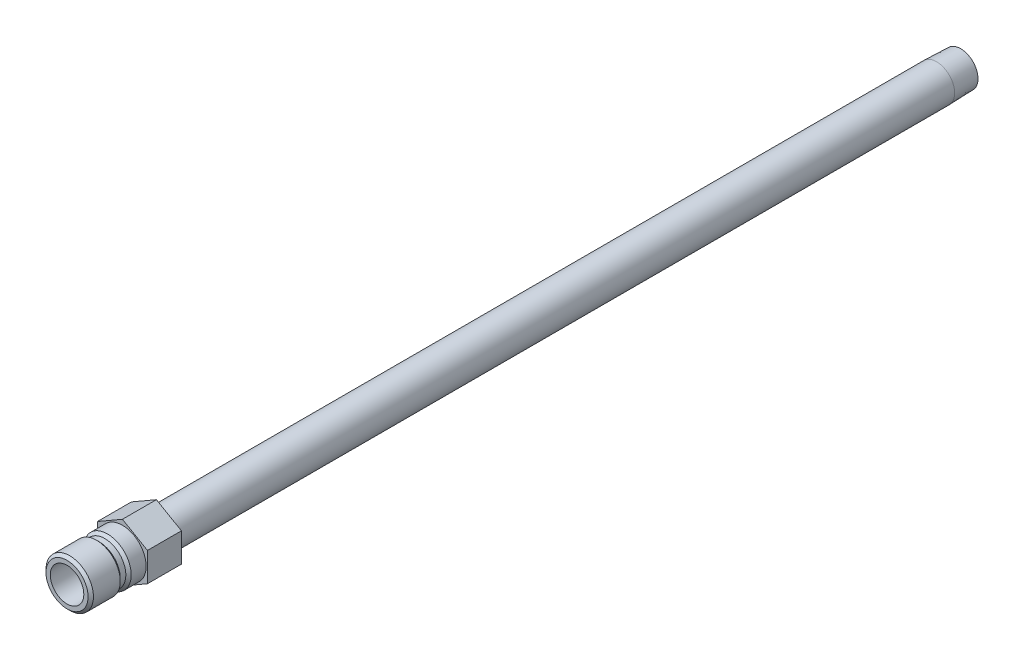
ISO-10303-21;
HEADER;
FILE_DESCRIPTION(('STEP AP214'),'2;1');
FILE_NAME('part.step','',(''),(''),'','','');
FILE_SCHEMA(('AUTOMOTIVE_DESIGN { 1 0 10303 214 1 1 1 1 }'));
ENDSEC;
DATA;
#1=APPLICATION_CONTEXT('core data for automotive mechanical design processes');
#2=APPLICATION_PROTOCOL_DEFINITION('international standard','automotive_design',2000,#1);
#3=PRODUCT_CONTEXT('',#1,'mechanical');
#4=PRODUCT('Part','Part','',(#3));
#5=PRODUCT_RELATED_PRODUCT_CATEGORY('part','',(#4));
#6=PRODUCT_DEFINITION_FORMATION('','',#4);
#7=PRODUCT_DEFINITION_CONTEXT('part definition',#1,'design');
#8=PRODUCT_DEFINITION('design','',#6,#7);
#9=PRODUCT_DEFINITION_SHAPE('','',#8);
#10=(LENGTH_UNIT() NAMED_UNIT(*) SI_UNIT(.MILLI.,.METRE.));
#11=(NAMED_UNIT(*) PLANE_ANGLE_UNIT() SI_UNIT($,.RADIAN.));
#12=(NAMED_UNIT(*) SI_UNIT($,.STERADIAN.) SOLID_ANGLE_UNIT());
#13=UNCERTAINTY_MEASURE_WITH_UNIT(LENGTH_MEASURE(1.E-05),#10,'distance_accuracy_value','');
#14=(GEOMETRIC_REPRESENTATION_CONTEXT(3) GLOBAL_UNCERTAINTY_ASSIGNED_CONTEXT((#13)) GLOBAL_UNIT_ASSIGNED_CONTEXT((#10,
#11,#12)) REPRESENTATION_CONTEXT('',''));
#15=CARTESIAN_POINT('',(0.,0.,0.));
#16=DIRECTION('',(0.,0.,1.));
#17=DIRECTION('',(1.,0.,0.));
#18=AXIS2_PLACEMENT_3D('',#15,#16,#17);
#19=CARTESIAN_POINT('',(0.,0.,-9.652));
#20=DIRECTION('',(0.,0.,-1.));
#21=DIRECTION('',(0.,1.,0.));
#22=AXIS2_PLACEMENT_3D('',#19,#20,#21);
#23=CYLINDRICAL_SURFACE('',#22,4.7625);
#24=CARTESIAN_POINT('',(0.,0.,3.556));
#25=DIRECTION('',(0.,0.,-1.));
#26=DIRECTION('',(0.,1.,0.));
#27=AXIS2_PLACEMENT_3D('',#24,#25,#26);
#28=CIRCLE('',#27,4.7625);
#29=CARTESIAN_POINT('',(0.,4.7625,3.556));
#30=VERTEX_POINT('',#29);
#31=EDGE_CURVE('E137',#30,#30,#28,.T.);
#32=ORIENTED_EDGE('',*,*,#31,.T.);
#33=EDGE_LOOP('',(#32));
#34=FACE_BOUND('',#33,.T.);
#35=CARTESIAN_POINT('',(0.,0.,15.748));
#36=DIRECTION('',(0.,0.,-1.));
#37=DIRECTION('',(0.,1.,0.));
#38=AXIS2_PLACEMENT_3D('',#35,#36,#37);
#39=CIRCLE('',#38,4.7625);
#40=CARTESIAN_POINT('',(0.,4.7625,15.748));
#41=VERTEX_POINT('',#40);
#42=EDGE_CURVE('E41',#41,#41,#39,.T.);
#43=ORIENTED_EDGE('',*,*,#42,.F.);
#44=EDGE_LOOP('',(#43));
#45=FACE_BOUND('',#44,.T.);
#46=ADVANCED_FACE('F33',(#34,#45),#23,.F.);
#47=CARTESIAN_POINT('',(0.,4.7625,15.748));
#48=DIRECTION('',(0.,0.,1.));
#49=DIRECTION('',(0.,-1.,0.));
#50=AXIS2_PLACEMENT_3D('',#47,#48,#49);
#51=PLANE('',#50);
#52=ORIENTED_EDGE('',*,*,#42,.T.);
#53=EDGE_LOOP('',(#52));
#54=FACE_BOUND('',#53,.T.);
#55=CARTESIAN_POINT('',(0.,0.,15.748));
#56=DIRECTION('',(0.,0.,-1.));
#57=DIRECTION('',(0.,1.,0.));
#58=AXIS2_PLACEMENT_3D('',#55,#56,#57);
#59=CIRCLE('',#58,5.9817);
#60=CARTESIAN_POINT('',(0.,5.9817,15.748));
#61=VERTEX_POINT('',#60);
#62=EDGE_CURVE('E175',#61,#61,#59,.T.);
#63=ORIENTED_EDGE('',*,*,#62,.F.);
#64=EDGE_LOOP('',(#63));
#65=FACE_BOUND('',#64,.T.);
#66=ADVANCED_FACE('F180',(#54,#65),#51,.T.);
#67=CARTESIAN_POINT('',(0.,0.,14.986));
#68=DIRECTION('',(0.,0.,-1.));
#69=DIRECTION('',(0.,1.,0.));
#70=AXIS2_PLACEMENT_3D('',#67,#68,#69);
#71=CONICAL_SURFACE('',#70,6.7437,0.785398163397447);
#72=ORIENTED_EDGE('',*,*,#62,.T.);
#73=EDGE_LOOP('',(#72));
#74=FACE_BOUND('',#73,.T.);
#75=CARTESIAN_POINT('',(0.,0.,14.986));
#76=DIRECTION('',(0.,0.,-1.));
#77=DIRECTION('',(0.,1.,0.));
#78=AXIS2_PLACEMENT_3D('',#75,#76,#77);
#79=CIRCLE('',#78,6.7437);
#80=CARTESIAN_POINT('',(0.,6.7437,14.986));
#81=VERTEX_POINT('',#80);
#82=EDGE_CURVE('E172',#81,#81,#79,.T.);
#83=ORIENTED_EDGE('',*,*,#82,.F.);
#84=EDGE_LOOP('',(#83));
#85=FACE_BOUND('',#84,.T.);
#86=ADVANCED_FACE('F188',(#74,#85),#71,.T.);
#87=CARTESIAN_POINT('',(0.,0.,-9.652));
#88=DIRECTION('',(0.,0.,-1.));
#89=DIRECTION('',(0.,1.,0.));
#90=AXIS2_PLACEMENT_3D('',#87,#88,#89);
#91=CYLINDRICAL_SURFACE('',#90,6.7437);
#92=ORIENTED_EDGE('',*,*,#82,.T.);
#93=EDGE_LOOP('',(#92));
#94=FACE_BOUND('',#93,.T.);
#95=CARTESIAN_POINT('',(0.,0.,7.366));
#96=DIRECTION('',(0.,0.,-1.));
#97=DIRECTION('',(0.,1.,0.));
#98=AXIS2_PLACEMENT_3D('',#95,#96,#97);
#99=CIRCLE('',#98,6.7437);
#100=CARTESIAN_POINT('',(0.,6.7437,7.366));
#101=VERTEX_POINT('',#100);
#102=EDGE_CURVE('E169',#101,#101,#99,.T.);
#103=ORIENTED_EDGE('',*,*,#102,.F.);
#104=EDGE_LOOP('',(#103));
#105=FACE_BOUND('',#104,.T.);
#106=ADVANCED_FACE('F237',(#94,#105),#91,.T.);
#107=CARTESIAN_POINT('',(0.,0.,6.604));
#108=DIRECTION('',(0.,0.,1.));
#109=DIRECTION('',(0.,-1.,0.));
#110=AXIS2_PLACEMENT_3D('',#107,#108,#109);
#111=CONICAL_SURFACE('',#110,5.9817,0.785398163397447);
#112=ORIENTED_EDGE('',*,*,#102,.T.);
#113=EDGE_LOOP('',(#112));
#114=FACE_BOUND('',#113,.T.);
#115=CARTESIAN_POINT('',(0.,0.,6.604));
#116=DIRECTION('',(0.,0.,-1.));
#117=DIRECTION('',(0.,1.,0.));
#118=AXIS2_PLACEMENT_3D('',#115,#116,#117);
#119=CIRCLE('',#118,5.9817);
#120=CARTESIAN_POINT('',(0.,5.9817,6.604));
#121=VERTEX_POINT('',#120);
#122=EDGE_CURVE('E166',#121,#121,#119,.T.);
#123=ORIENTED_EDGE('',*,*,#122,.F.);
#124=EDGE_LOOP('',(#123));
#125=FACE_BOUND('',#124,.T.);
#126=ADVANCED_FACE('F233',(#114,#125),#111,.T.);
#127=CARTESIAN_POINT('',(0.,0.,-9.652));
#128=DIRECTION('',(0.,0.,-1.));
#129=DIRECTION('',(0.,1.,0.));
#130=AXIS2_PLACEMENT_3D('',#127,#128,#129);
#131=CYLINDRICAL_SURFACE('',#130,5.9817);
#132=ORIENTED_EDGE('',*,*,#122,.T.);
#133=EDGE_LOOP('',(#132));
#134=FACE_BOUND('',#133,.T.);
#135=CARTESIAN_POINT('',(0.,0.,5.0165));
#136=DIRECTION('',(0.,0.,-1.));
#137=DIRECTION('',(0.,1.,0.));
#138=AXIS2_PLACEMENT_3D('',#135,#136,#137);
#139=CIRCLE('',#138,5.9817);
#140=CARTESIAN_POINT('',(0.,5.9817,5.0165));
#141=VERTEX_POINT('',#140);
#142=EDGE_CURVE('E163',#141,#141,#139,.T.);
#143=ORIENTED_EDGE('',*,*,#142,.F.);
#144=EDGE_LOOP('',(#143));
#145=FACE_BOUND('',#144,.T.);
#146=ADVANCED_FACE('F229',(#134,#145),#131,.T.);
#147=CARTESIAN_POINT('',(0.,0.,4.2545));
#148=DIRECTION('',(0.,0.,-1.));
#149=DIRECTION('',(0.,1.,0.));
#150=AXIS2_PLACEMENT_3D('',#147,#148,#149);
#151=CONICAL_SURFACE('',#150,6.7437,0.785398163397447);
#152=ORIENTED_EDGE('',*,*,#142,.T.);
#153=EDGE_LOOP('',(#152));
#154=FACE_BOUND('',#153,.T.);
#155=CARTESIAN_POINT('',(0.,0.,4.2545));
#156=DIRECTION('',(0.,0.,-1.));
#157=DIRECTION('',(0.,1.,0.));
#158=AXIS2_PLACEMENT_3D('',#155,#156,#157);
#159=CIRCLE('',#158,6.7437);
#160=CARTESIAN_POINT('',(0.,6.7437,4.2545));
#161=VERTEX_POINT('',#160);
#162=EDGE_CURVE('E160',#161,#161,#159,.T.);
#163=ORIENTED_EDGE('',*,*,#162,.F.);
#164=EDGE_LOOP('',(#163));
#165=FACE_BOUND('',#164,.T.);
#166=ADVANCED_FACE('F225',(#154,#165),#151,.T.);
#167=CARTESIAN_POINT('',(0.,0.,-9.652));
#168=DIRECTION('',(0.,0.,-1.));
#169=DIRECTION('',(0.,1.,0.));
#170=AXIS2_PLACEMENT_3D('',#167,#168,#169);
#171=CYLINDRICAL_SURFACE('',#170,6.7437);
#172=CARTESIAN_POINT('',(0.,0.,0.));
#173=DIRECTION('',(0.,0.,1.));
#174=DIRECTION('',(1.,0.,0.));
#175=AXIS2_PLACEMENT_3D('',#172,#173,#174);
#176=CIRCLE('',#175,6.7437);
#177=CARTESIAN_POINT('',(6.7437,0.,0.));
#178=VERTEX_POINT('',#177);
#179=EDGE_CURVE('E11',#178,#178,#176,.F.);
#180=ORIENTED_EDGE('',*,*,#179,.F.);
#181=EDGE_LOOP('',(#180));
#182=FACE_BOUND('',#181,.T.);
#183=ORIENTED_EDGE('',*,*,#162,.T.);
#184=EDGE_LOOP('',(#183));
#185=FACE_BOUND('',#184,.T.);
#186=ADVANCED_FACE('F221',(#182,#185),#171,.T.);
#187=CARTESIAN_POINT('',(0.,6.7437,-9.652));
#188=DIRECTION('',(0.,0.,-1.));
#189=DIRECTION('',(0.,1.,0.));
#190=AXIS2_PLACEMENT_3D('',#187,#188,#189);
#191=PLANE('',#190);
#192=CARTESIAN_POINT('',(0.,0.,-9.652));
#193=DIRECTION('',(0.,0.,-1.));
#194=DIRECTION('',(0.,1.,0.));
#195=AXIS2_PLACEMENT_3D('',#192,#193,#194);
#196=CIRCLE('',#195,5.1435);
#197=CARTESIAN_POINT('',(0.,5.1435,-9.652));
#198=VERTEX_POINT('',#197);
#199=EDGE_CURVE('E157',#198,#198,#196,.T.);
#200=ORIENTED_EDGE('',*,*,#199,.F.);
#201=EDGE_LOOP('',(#200));
#202=FACE_BOUND('',#201,.T.);
#203=DIRECTION('',(-0.866025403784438,-0.5,0.));
#204=VECTOR('',#203,1.);
#205=CARTESIAN_POINT('',(0.,8.21223022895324,-9.652));
#206=LINE('',#205,#204);
#207=CARTESIAN_POINT('',(0.,8.21223022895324,-9.652));
#208=VERTEX_POINT('',#207);
#209=CARTESIAN_POINT('',(-7.112,4.10611511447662,-9.652));
#210=VERTEX_POINT('',#209);
#211=EDGE_CURVE('E135',#208,#210,#206,.T.);
#212=ORIENTED_EDGE('',*,*,#211,.F.);
#213=DIRECTION('',(-0.866025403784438,0.5,0.));
#214=VECTOR('',#213,1.);
#215=CARTESIAN_POINT('',(7.112,4.10611511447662,-9.652));
#216=LINE('',#215,#214);
#217=CARTESIAN_POINT('',(7.112,4.10611511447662,-9.652));
#218=VERTEX_POINT('',#217);
#219=EDGE_CURVE('E110',#218,#208,#216,.T.);
#220=ORIENTED_EDGE('',*,*,#219,.F.);
#221=DIRECTION('',(0.,1.,0.));
#222=VECTOR('',#221,1.);
#223=CARTESIAN_POINT('',(7.112,-4.10611511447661,-9.652));
#224=LINE('',#223,#222);
#225=CARTESIAN_POINT('',(7.112,-4.10611511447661,-9.652));
#226=VERTEX_POINT('',#225);
#227=EDGE_CURVE('E95',#226,#218,#224,.T.);
#228=ORIENTED_EDGE('',*,*,#227,.F.);
#229=DIRECTION('',(0.866025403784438,0.5,0.));
#230=VECTOR('',#229,1.);
#231=CARTESIAN_POINT('',(0.,-8.21223022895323,-9.652));
#232=LINE('',#231,#230);
#233=CARTESIAN_POINT('',(0.,-8.21223022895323,-9.652));
#234=VERTEX_POINT('',#233);
#235=EDGE_CURVE('E108',#234,#226,#232,.T.);
#236=ORIENTED_EDGE('',*,*,#235,.F.);
#237=DIRECTION('',(0.866025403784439,-0.5,0.));
#238=VECTOR('',#237,1.);
#239=CARTESIAN_POINT('',(-7.112,-4.10611511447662,-9.652));
#240=LINE('',#239,#238);
#241=CARTESIAN_POINT('',(-7.112,-4.10611511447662,-9.652));
#242=VERTEX_POINT('',#241);
#243=EDGE_CURVE('E113',#242,#234,#240,.T.);
#244=ORIENTED_EDGE('',*,*,#243,.F.);
#245=DIRECTION('',(0.,-1.,0.));
#246=VECTOR('',#245,1.);
#247=CARTESIAN_POINT('',(-7.112,4.10611511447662,-9.652));
#248=LINE('',#247,#246);
#249=EDGE_CURVE('E115',#210,#242,#248,.T.);
#250=ORIENTED_EDGE('',*,*,#249,.F.);
#251=EDGE_LOOP('',(#212,#220,#228,#236,#244,#250));
#252=FACE_BOUND('',#251,.T.);
#253=ADVANCED_FACE('F106',(#202,#252),#191,.T.);
#254=CARTESIAN_POINT('',(0.,0.,-9.652));
#255=DIRECTION('',(0.,0.,-1.));
#256=DIRECTION('',(0.,1.,0.));
#257=AXIS2_PLACEMENT_3D('',#254,#255,#256);
#258=CYLINDRICAL_SURFACE('',#257,5.14349999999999);
#259=ORIENTED_EDGE('',*,*,#199,.T.);
#260=EDGE_LOOP('',(#259));
#261=FACE_BOUND('',#260,.T.);
#262=CARTESIAN_POINT('',(0.,0.,-231.394));
#263=DIRECTION('',(0.,0.,-1.));
#264=DIRECTION('',(0.,1.,0.));
#265=AXIS2_PLACEMENT_3D('',#262,#263,#264);
#266=CIRCLE('',#265,5.14349999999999);
#267=CARTESIAN_POINT('',(0.,5.1435,-231.394));
#268=VERTEX_POINT('',#267);
#269=EDGE_CURVE('E154',#268,#268,#266,.T.);
#270=ORIENTED_EDGE('',*,*,#269,.F.);
#271=EDGE_LOOP('',(#270));
#272=FACE_BOUND('',#271,.T.);
#273=ADVANCED_FACE('F214',(#261,#272),#258,.T.);
#274=CARTESIAN_POINT('',(0.,0.,-238.252));
#275=DIRECTION('',(0.,0.,1.));
#276=DIRECTION('',(0.,-1.,0.));
#277=AXIS2_PLACEMENT_3D('',#274,#275,#276);
#278=CONICAL_SURFACE('',#277,4.92918877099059,0.0312396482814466);
#279=ORIENTED_EDGE('',*,*,#269,.T.);
#280=EDGE_LOOP('',(#279));
#281=FACE_BOUND('',#280,.T.);
#282=CARTESIAN_POINT('',(0.,0.,-238.252));
#283=DIRECTION('',(0.,0.,-1.));
#284=DIRECTION('',(0.,1.,0.));
#285=AXIS2_PLACEMENT_3D('',#282,#283,#284);
#286=CIRCLE('',#285,4.92918877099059);
#287=CARTESIAN_POINT('',(0.,4.9291887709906,-238.252));
#288=VERTEX_POINT('',#287);
#289=EDGE_CURVE('E151',#288,#288,#286,.T.);
#290=ORIENTED_EDGE('',*,*,#289,.F.);
#291=EDGE_LOOP('',(#290));
#292=FACE_BOUND('',#291,.T.);
#293=ADVANCED_FACE('F210',(#281,#292),#278,.T.);
#294=CARTESIAN_POINT('',(0.,4.9291887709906,-238.252));
#295=DIRECTION('',(0.,0.,-1.));
#296=DIRECTION('',(0.,1.,0.));
#297=AXIS2_PLACEMENT_3D('',#294,#295,#296);
#298=PLANE('',#297);
#299=ORIENTED_EDGE('',*,*,#289,.T.);
#300=EDGE_LOOP('',(#299));
#301=FACE_BOUND('',#300,.T.);
#302=CARTESIAN_POINT('',(0.,0.,-238.252));
#303=DIRECTION('',(0.,0.,-1.));
#304=DIRECTION('',(0.,1.,0.));
#305=AXIS2_PLACEMENT_3D('',#302,#303,#304);
#306=CIRCLE('',#305,3.41629999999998);
#307=CARTESIAN_POINT('',(0.,3.4163,-238.252));
#308=VERTEX_POINT('',#307);
#309=EDGE_CURVE('E148',#308,#308,#306,.T.);
#310=ORIENTED_EDGE('',*,*,#309,.F.);
#311=EDGE_LOOP('',(#310));
#312=FACE_BOUND('',#311,.T.);
#313=ADVANCED_FACE('F203',(#301,#312),#298,.T.);
#314=CARTESIAN_POINT('',(0.,0.,-9.652));
#315=DIRECTION('',(0.,0.,-1.));
#316=DIRECTION('',(0.,1.,0.));
#317=AXIS2_PLACEMENT_3D('',#314,#315,#316);
#318=CYLINDRICAL_SURFACE('',#317,3.41629999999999);
#319=ORIENTED_EDGE('',*,*,#309,.T.);
#320=EDGE_LOOP('',(#319));
#321=FACE_BOUND('',#320,.T.);
#322=CARTESIAN_POINT('',(0.,0.,2.84021276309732));
#323=DIRECTION('',(0.,0.,-1.));
#324=DIRECTION('',(0.,1.,0.));
#325=AXIS2_PLACEMENT_3D('',#322,#323,#324);
#326=CIRCLE('',#325,3.4163);
#327=CARTESIAN_POINT('',(0.,3.4163,2.84021276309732));
#328=VERTEX_POINT('',#327);
#329=EDGE_CURVE('E145',#328,#328,#326,.T.);
#330=ORIENTED_EDGE('',*,*,#329,.F.);
#331=EDGE_LOOP('',(#330));
#332=FACE_BOUND('',#331,.T.);
#333=ADVANCED_FACE('F194',(#321,#332),#318,.F.);
#334=CARTESIAN_POINT('',(0.,0.,3.556));
#335=DIRECTION('',(0.,0.,1.));
#336=DIRECTION('',(0.,-1.,0.));
#337=AXIS2_PLACEMENT_3D('',#334,#335,#336);
#338=CONICAL_SURFACE('',#337,4.7625,1.08210413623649);
#339=ORIENTED_EDGE('',*,*,#329,.T.);
#340=EDGE_LOOP('',(#339));
#341=FACE_BOUND('',#340,.T.);
#342=ORIENTED_EDGE('',*,*,#31,.F.);
#343=EDGE_LOOP('',(#342));
#344=FACE_BOUND('',#343,.T.);
#345=ADVANCED_FACE('F191',(#341,#344),#338,.F.);
#346=CARTESIAN_POINT('',(0.,8.21223022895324,-9.652));
#347=DIRECTION('',(-0.5,0.866025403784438,0.));
#348=DIRECTION('',(-0.866025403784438,-0.5,0.));
#349=AXIS2_PLACEMENT_3D('',#346,#347,#348);
#350=PLANE('',#349);
#351=DIRECTION('',(-0.866025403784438,-0.5,0.));
#352=VECTOR('',#351,1.);
#353=CARTESIAN_POINT('',(0.,8.21223022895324,0.));
#354=LINE('',#353,#352);
#355=CARTESIAN_POINT('',(0.,8.21223022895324,0.));
#356=VERTEX_POINT('',#355);
#357=CARTESIAN_POINT('',(-7.112,4.10611511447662,0.));
#358=VERTEX_POINT('',#357);
#359=EDGE_CURVE('E120',#356,#358,#354,.T.);
#360=ORIENTED_EDGE('',*,*,#359,.F.);
#361=DIRECTION('',(0.,0.,1.));
#362=VECTOR('',#361,1.);
#363=CARTESIAN_POINT('',(0.,8.21223022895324,-9.652));
#364=LINE('',#363,#362);
#365=EDGE_CURVE('E49',#208,#356,#364,.T.);
#366=ORIENTED_EDGE('',*,*,#365,.F.);
#367=ORIENTED_EDGE('',*,*,#211,.T.);
#368=DIRECTION('',(0.,0.,1.));
#369=VECTOR('',#368,1.);
#370=CARTESIAN_POINT('',(-7.112,4.10611511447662,-9.652));
#371=LINE('',#370,#369);
#372=EDGE_CURVE('E84',#210,#358,#371,.T.);
#373=ORIENTED_EDGE('',*,*,#372,.T.);
#374=EDGE_LOOP('',(#360,#366,#367,#373));
#375=FACE_BOUND('',#374,.T.);
#376=ADVANCED_FACE('F193',(#375),#350,.T.);
#377=CARTESIAN_POINT('',(7.112,4.10611511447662,-9.652));
#378=DIRECTION('',(0.5,0.866025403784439,0.));
#379=DIRECTION('',(-0.866025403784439,0.5,0.));
#380=AXIS2_PLACEMENT_3D('',#377,#378,#379);
#381=PLANE('',#380);
#382=DIRECTION('',(-0.866025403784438,0.5,0.));
#383=VECTOR('',#382,1.);
#384=CARTESIAN_POINT('',(7.112,4.10611511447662,0.));
#385=LINE('',#384,#383);
#386=CARTESIAN_POINT('',(7.112,4.10611511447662,0.));
#387=VERTEX_POINT('',#386);
#388=EDGE_CURVE('E132',#387,#356,#385,.T.);
#389=ORIENTED_EDGE('',*,*,#388,.F.);
#390=DIRECTION('',(0.,0.,1.));
#391=VECTOR('',#390,1.);
#392=CARTESIAN_POINT('',(7.112,4.10611511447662,-9.652));
#393=LINE('',#392,#391);
#394=EDGE_CURVE('E72',#218,#387,#393,.T.);
#395=ORIENTED_EDGE('',*,*,#394,.F.);
#396=ORIENTED_EDGE('',*,*,#219,.T.);
#397=ORIENTED_EDGE('',*,*,#365,.T.);
#398=EDGE_LOOP('',(#389,#395,#396,#397));
#399=FACE_BOUND('',#398,.T.);
#400=ADVANCED_FACE('F201',(#399),#381,.T.);
#401=CARTESIAN_POINT('',(7.112,-4.10611511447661,-9.652));
#402=DIRECTION('',(1.,0.,0.));
#403=DIRECTION('',(0.,1.,0.));
#404=AXIS2_PLACEMENT_3D('',#401,#402,#403);
#405=PLANE('',#404);
#406=DIRECTION('',(0.,1.,0.));
#407=VECTOR('',#406,1.);
#408=CARTESIAN_POINT('',(7.112,-4.10611511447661,0.));
#409=LINE('',#408,#407);
#410=CARTESIAN_POINT('',(7.112,-4.10611511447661,0.));
#411=VERTEX_POINT('',#410);
#412=EDGE_CURVE('E97',#411,#387,#409,.T.);
#413=ORIENTED_EDGE('',*,*,#412,.F.);
#414=DIRECTION('',(0.,0.,1.));
#415=VECTOR('',#414,1.);
#416=CARTESIAN_POINT('',(7.112,-4.10611511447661,-9.652));
#417=LINE('',#416,#415);
#418=EDGE_CURVE('E92',#226,#411,#417,.T.);
#419=ORIENTED_EDGE('',*,*,#418,.F.);
#420=ORIENTED_EDGE('',*,*,#227,.T.);
#421=ORIENTED_EDGE('',*,*,#394,.T.);
#422=EDGE_LOOP('',(#413,#419,#420,#421));
#423=FACE_BOUND('',#422,.T.);
#424=ADVANCED_FACE('F94',(#423),#405,.T.);
#425=CARTESIAN_POINT('',(0.,-8.21223022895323,-9.652));
#426=DIRECTION('',(0.5,-0.866025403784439,0.));
#427=DIRECTION('',(0.866025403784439,0.5,0.));
#428=AXIS2_PLACEMENT_3D('',#425,#426,#427);
#429=PLANE('',#428);
#430=DIRECTION('',(0.866025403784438,0.5,0.));
#431=VECTOR('',#430,1.);
#432=CARTESIAN_POINT('',(0.,-8.21223022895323,0.));
#433=LINE('',#432,#431);
#434=CARTESIAN_POINT('',(0.,-8.21223022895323,0.));
#435=VERTEX_POINT('',#434);
#436=EDGE_CURVE('E129',#435,#411,#433,.T.);
#437=ORIENTED_EDGE('',*,*,#436,.F.);
#438=DIRECTION('',(0.,0.,1.));
#439=VECTOR('',#438,1.);
#440=CARTESIAN_POINT('',(0.,-8.21223022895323,-9.652));
#441=LINE('',#440,#439);
#442=EDGE_CURVE('E102',#234,#435,#441,.T.);
#443=ORIENTED_EDGE('',*,*,#442,.F.);
#444=ORIENTED_EDGE('',*,*,#235,.T.);
#445=ORIENTED_EDGE('',*,*,#418,.T.);
#446=EDGE_LOOP('',(#437,#443,#444,#445));
#447=FACE_BOUND('',#446,.T.);
#448=ADVANCED_FACE('F112',(#447),#429,.T.);
#449=CARTESIAN_POINT('',(-7.112,-4.10611511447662,-9.652));
#450=DIRECTION('',(-0.5,-0.866025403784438,0.));
#451=DIRECTION('',(0.866025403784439,-0.5,0.));
#452=AXIS2_PLACEMENT_3D('',#449,#450,#451);
#453=PLANE('',#452);
#454=DIRECTION('',(0.866025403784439,-0.5,0.));
#455=VECTOR('',#454,1.);
#456=CARTESIAN_POINT('',(-7.112,-4.10611511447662,0.));
#457=LINE('',#456,#455);
#458=CARTESIAN_POINT('',(-7.112,-4.10611511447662,0.));
#459=VERTEX_POINT('',#458);
#460=EDGE_CURVE('E126',#459,#435,#457,.T.);
#461=ORIENTED_EDGE('',*,*,#460,.F.);
#462=DIRECTION('',(0.,0.,1.));
#463=VECTOR('',#462,1.);
#464=CARTESIAN_POINT('',(-7.112,-4.10611511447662,-9.652));
#465=LINE('',#464,#463);
#466=EDGE_CURVE('E140',#242,#459,#465,.T.);
#467=ORIENTED_EDGE('',*,*,#466,.F.);
#468=ORIENTED_EDGE('',*,*,#243,.T.);
#469=ORIENTED_EDGE('',*,*,#442,.T.);
#470=EDGE_LOOP('',(#461,#467,#468,#469));
#471=FACE_BOUND('',#470,.T.);
#472=ADVANCED_FACE('F338',(#471),#453,.T.);
#473=CARTESIAN_POINT('',(-7.112,4.10611511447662,-9.652));
#474=DIRECTION('',(-1.,0.,0.));
#475=DIRECTION('',(0.,-1.,0.));
#476=AXIS2_PLACEMENT_3D('',#473,#474,#475);
#477=PLANE('',#476);
#478=DIRECTION('',(0.,-1.,0.));
#479=VECTOR('',#478,1.);
#480=CARTESIAN_POINT('',(-7.112,4.10611511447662,0.));
#481=LINE('',#480,#479);
#482=EDGE_CURVE('E123',#358,#459,#481,.T.);
#483=ORIENTED_EDGE('',*,*,#482,.F.);
#484=ORIENTED_EDGE('',*,*,#372,.F.);
#485=ORIENTED_EDGE('',*,*,#249,.T.);
#486=ORIENTED_EDGE('',*,*,#466,.T.);
#487=EDGE_LOOP('',(#483,#484,#485,#486));
#488=FACE_BOUND('',#487,.T.);
#489=ADVANCED_FACE('F346',(#488),#477,.T.);
#490=CARTESIAN_POINT('',(-7.112,4.10611511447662,0.));
#491=DIRECTION('',(0.,0.,1.));
#492=DIRECTION('',(1.,0.,0.));
#493=AXIS2_PLACEMENT_3D('',#490,#491,#492);
#494=PLANE('',#493);
#495=ORIENTED_EDGE('',*,*,#179,.T.);
#496=EDGE_LOOP('',(#495));
#497=FACE_BOUND('',#496,.T.);
#498=ORIENTED_EDGE('',*,*,#359,.T.);
#499=ORIENTED_EDGE('',*,*,#482,.T.);
#500=ORIENTED_EDGE('',*,*,#460,.T.);
#501=ORIENTED_EDGE('',*,*,#436,.T.);
#502=ORIENTED_EDGE('',*,*,#412,.T.);
#503=ORIENTED_EDGE('',*,*,#388,.T.);
#504=EDGE_LOOP('',(#498,#499,#500,#501,#502,#503));
#505=FACE_BOUND('',#504,.T.);
#506=ADVANCED_FACE('F355',(#497,#505),#494,.T.);
#507=CLOSED_SHELL('',(#46,#66,#86,#106,#126,#146,#166,#186,#253,#273,#293,#313,#333,#345,#376,
#400,#424,#448,#472,#489,#506));
#508=MANIFOLD_SOLID_BREP('B2',#507);
#509=ADVANCED_BREP_SHAPE_REPRESENTATION('',(#18,#508),#14);
#510=SHAPE_DEFINITION_REPRESENTATION(#9,#509);
ENDSEC;
END-ISO-10303-21;
